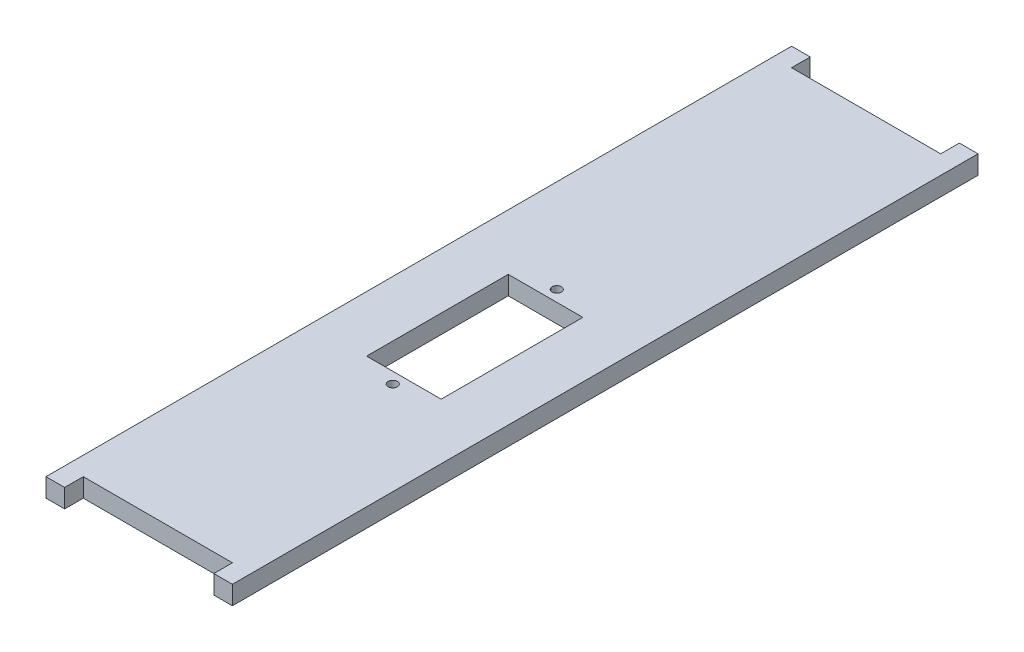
ISO-10303-21;
HEADER;
FILE_DESCRIPTION(('STEP AP214'),'2;1');
FILE_NAME('part.step','',(''),(''),'','','');
FILE_SCHEMA(('AUTOMOTIVE_DESIGN { 1 0 10303 214 1 1 1 1 }'));
ENDSEC;
DATA;
#1=APPLICATION_CONTEXT('core data for automotive mechanical design processes');
#2=APPLICATION_PROTOCOL_DEFINITION('international standard','automotive_design',2000,#1);
#3=PRODUCT_CONTEXT('',#1,'mechanical');
#4=PRODUCT('Part','Part','',(#3));
#5=PRODUCT_RELATED_PRODUCT_CATEGORY('part','',(#4));
#6=PRODUCT_DEFINITION_FORMATION('','',#4);
#7=PRODUCT_DEFINITION_CONTEXT('part definition',#1,'design');
#8=PRODUCT_DEFINITION('design','',#6,#7);
#9=PRODUCT_DEFINITION_SHAPE('','',#8);
#10=(LENGTH_UNIT() NAMED_UNIT(*) SI_UNIT(.MILLI.,.METRE.));
#11=(NAMED_UNIT(*) PLANE_ANGLE_UNIT() SI_UNIT($,.RADIAN.));
#12=(NAMED_UNIT(*) SI_UNIT($,.STERADIAN.) SOLID_ANGLE_UNIT());
#13=UNCERTAINTY_MEASURE_WITH_UNIT(LENGTH_MEASURE(1.E-05),#10,'distance_accuracy_value','');
#14=(GEOMETRIC_REPRESENTATION_CONTEXT(3) GLOBAL_UNCERTAINTY_ASSIGNED_CONTEXT((#13)) GLOBAL_UNIT_ASSIGNED_CONTEXT((#10,
#11,#12)) REPRESENTATION_CONTEXT('',''));
#15=CARTESIAN_POINT('',(0.,0.,0.));
#16=DIRECTION('',(0.,0.,1.));
#17=DIRECTION('',(1.,0.,0.));
#18=AXIS2_PLACEMENT_3D('',#15,#16,#17);
#19=CARTESIAN_POINT('',(-15.875,1.5875,-63.5));
#20=DIRECTION('',(0.,0.,1.));
#21=DIRECTION('',(1.,0.,0.));
#22=AXIS2_PLACEMENT_3D('',#19,#20,#21);
#23=PLANE('',#22);
#24=DIRECTION('',(-1.,0.,0.));
#25=VECTOR('',#24,1.);
#26=CARTESIAN_POINT('',(-15.875,1.5875,-63.5));
#27=LINE('',#26,#25);
#28=CARTESIAN_POINT('',(-12.7000000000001,1.5875,-63.5));
#29=VERTEX_POINT('',#28);
#30=CARTESIAN_POINT('',(-15.875,1.5875,-63.5));
#31=VERTEX_POINT('',#30);
#32=EDGE_CURVE('E244',#29,#31,#27,.T.);
#33=ORIENTED_EDGE('',*,*,#32,.F.);
#34=DIRECTION('',(0.,1.,0.));
#35=VECTOR('',#34,1.);
#36=CARTESIAN_POINT('',(-12.7000000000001,-1.5875,-63.5));
#37=LINE('',#36,#35);
#38=CARTESIAN_POINT('',(-12.7000000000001,-1.5875,-63.5));
#39=VERTEX_POINT('',#38);
#40=EDGE_CURVE('E206',#39,#29,#37,.T.);
#41=ORIENTED_EDGE('',*,*,#40,.F.);
#42=DIRECTION('',(-1.,0.,0.));
#43=VECTOR('',#42,1.);
#44=CARTESIAN_POINT('',(-15.875,-1.5875,-63.5));
#45=LINE('',#44,#43);
#46=CARTESIAN_POINT('',(-15.875,-1.5875,-63.5));
#47=VERTEX_POINT('',#46);
#48=EDGE_CURVE('E258',#39,#47,#45,.T.);
#49=ORIENTED_EDGE('',*,*,#48,.T.);
#50=DIRECTION('',(0.,-1.,0.));
#51=VECTOR('',#50,1.);
#52=CARTESIAN_POINT('',(-15.875,1.5875,-63.5));
#53=LINE('',#52,#51);
#54=EDGE_CURVE('E42',#31,#47,#53,.T.);
#55=ORIENTED_EDGE('',*,*,#54,.F.);
#56=EDGE_LOOP('',(#33,#41,#49,#55));
#57=FACE_BOUND('',#56,.T.);
#58=ADVANCED_FACE('F33',(#57),#23,.F.);
#59=CARTESIAN_POINT('',(-15.875,1.5875,63.5));
#60=DIRECTION('',(0.,0.,-1.));
#61=DIRECTION('',(-1.,0.,0.));
#62=AXIS2_PLACEMENT_3D('',#59,#60,#61);
#63=PLANE('',#62);
#64=DIRECTION('',(1.,0.,0.));
#65=VECTOR('',#64,1.);
#66=CARTESIAN_POINT('',(-15.875,1.5875,63.5));
#67=LINE('',#66,#65);
#68=CARTESIAN_POINT('',(12.6999999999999,1.5875,63.5));
#69=VERTEX_POINT('',#68);
#70=CARTESIAN_POINT('',(15.875,1.5875,63.5));
#71=VERTEX_POINT('',#70);
#72=EDGE_CURVE('E251',#69,#71,#67,.T.);
#73=ORIENTED_EDGE('',*,*,#72,.F.);
#74=DIRECTION('',(0.,1.,0.));
#75=VECTOR('',#74,1.);
#76=CARTESIAN_POINT('',(12.6999999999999,-1.5875,63.5));
#77=LINE('',#76,#75);
#78=CARTESIAN_POINT('',(12.6999999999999,-1.5875,63.5));
#79=VERTEX_POINT('',#78);
#80=EDGE_CURVE('E232',#79,#69,#77,.T.);
#81=ORIENTED_EDGE('',*,*,#80,.F.);
#82=DIRECTION('',(1.,0.,0.));
#83=VECTOR('',#82,1.);
#84=CARTESIAN_POINT('',(-15.875,-1.5875,63.5));
#85=LINE('',#84,#83);
#86=CARTESIAN_POINT('',(15.875,-1.5875,63.5));
#87=VERTEX_POINT('',#86);
#88=EDGE_CURVE('E264',#79,#87,#85,.T.);
#89=ORIENTED_EDGE('',*,*,#88,.T.);
#90=DIRECTION('',(0.,-1.,0.));
#91=VECTOR('',#90,1.);
#92=CARTESIAN_POINT('',(15.875,1.5875,63.5));
#93=LINE('',#92,#91);
#94=EDGE_CURVE('E255',#71,#87,#93,.T.);
#95=ORIENTED_EDGE('',*,*,#94,.F.);
#96=EDGE_LOOP('',(#73,#81,#89,#95));
#97=FACE_BOUND('',#96,.T.);
#98=ADVANCED_FACE('F329',(#97),#63,.F.);
#99=CARTESIAN_POINT('',(15.875,1.5875,-63.5));
#100=DIRECTION('',(-1.,0.,0.));
#101=DIRECTION('',(0.,0.,1.));
#102=AXIS2_PLACEMENT_3D('',#99,#100,#101);
#103=PLANE('',#102);
#104=DIRECTION('',(0.,0.,-1.));
#105=VECTOR('',#104,1.);
#106=CARTESIAN_POINT('',(15.875,-1.5875,-63.5));
#107=LINE('',#106,#105);
#108=CARTESIAN_POINT('',(15.875,-1.5875,-63.5));
#109=VERTEX_POINT('',#108);
#110=EDGE_CURVE('E234',#87,#109,#107,.T.);
#111=ORIENTED_EDGE('',*,*,#110,.T.);
#112=DIRECTION('',(0.,-1.,0.));
#113=VECTOR('',#112,1.);
#114=CARTESIAN_POINT('',(15.875,1.5875,-63.5));
#115=LINE('',#114,#113);
#116=CARTESIAN_POINT('',(15.875,1.5875,-63.5));
#117=VERTEX_POINT('',#116);
#118=EDGE_CURVE('E11',#117,#109,#115,.T.);
#119=ORIENTED_EDGE('',*,*,#118,.F.);
#120=DIRECTION('',(0.,0.,-1.));
#121=VECTOR('',#120,1.);
#122=CARTESIAN_POINT('',(15.875,1.5875,-63.5));
#123=LINE('',#122,#121);
#124=EDGE_CURVE('E241',#71,#117,#123,.T.);
#125=ORIENTED_EDGE('',*,*,#124,.F.);
#126=ORIENTED_EDGE('',*,*,#94,.T.);
#127=EDGE_LOOP('',(#111,#119,#125,#126));
#128=FACE_BOUND('',#127,.T.);
#129=ADVANCED_FACE('F35',(#128),#103,.F.);
#130=CARTESIAN_POINT('',(12.6999999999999,-1.5875,-63.5));
#131=VERTEX_POINT('',#130);
#132=EDGE_CURVE('E259',#109,#131,#45,.T.);
#133=ORIENTED_EDGE('',*,*,#132,.T.);
#134=DIRECTION('',(0.,1.,0.));
#135=VECTOR('',#134,1.);
#136=CARTESIAN_POINT('',(12.6999999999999,-1.5875,-63.5));
#137=LINE('',#136,#135);
#138=CARTESIAN_POINT('',(12.6999999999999,1.5875,-63.5));
#139=VERTEX_POINT('',#138);
#140=EDGE_CURVE('E209',#131,#139,#137,.T.);
#141=ORIENTED_EDGE('',*,*,#140,.T.);
#142=EDGE_CURVE('E246',#117,#139,#27,.T.);
#143=ORIENTED_EDGE('',*,*,#142,.F.);
#144=ORIENTED_EDGE('',*,*,#118,.T.);
#145=EDGE_LOOP('',(#133,#141,#143,#144));
#146=FACE_BOUND('',#145,.T.);
#147=ADVANCED_FACE('F335',(#146),#23,.F.);
#148=CARTESIAN_POINT('',(-15.875,1.5875,-63.5));
#149=DIRECTION('',(1.,0.,0.));
#150=DIRECTION('',(0.,0.,-1.));
#151=AXIS2_PLACEMENT_3D('',#148,#149,#150);
#152=PLANE('',#151);
#153=DIRECTION('',(0.,0.,1.));
#154=VECTOR('',#153,1.);
#155=CARTESIAN_POINT('',(-15.875,-1.5875,-63.5));
#156=LINE('',#155,#154);
#157=CARTESIAN_POINT('',(-15.875,-1.5875,63.5));
#158=VERTEX_POINT('',#157);
#159=EDGE_CURVE('E262',#47,#158,#156,.T.);
#160=ORIENTED_EDGE('',*,*,#159,.T.);
#161=DIRECTION('',(0.,-1.,0.));
#162=VECTOR('',#161,1.);
#163=CARTESIAN_POINT('',(-15.875,1.5875,63.5));
#164=LINE('',#163,#162);
#165=CARTESIAN_POINT('',(-15.875,1.5875,63.5));
#166=VERTEX_POINT('',#165);
#167=EDGE_CURVE('E269',#166,#158,#164,.T.);
#168=ORIENTED_EDGE('',*,*,#167,.F.);
#169=DIRECTION('',(0.,0.,1.));
#170=VECTOR('',#169,1.);
#171=CARTESIAN_POINT('',(-15.875,1.5875,-63.5));
#172=LINE('',#171,#170);
#173=EDGE_CURVE('E249',#31,#166,#172,.T.);
#174=ORIENTED_EDGE('',*,*,#173,.F.);
#175=ORIENTED_EDGE('',*,*,#54,.T.);
#176=EDGE_LOOP('',(#160,#168,#174,#175));
#177=FACE_BOUND('',#176,.T.);
#178=ADVANCED_FACE('F310',(#177),#152,.F.);
#179=CARTESIAN_POINT('',(-12.7000000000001,-1.5875,63.5));
#180=VERTEX_POINT('',#179);
#181=EDGE_CURVE('E245',#158,#180,#85,.T.);
#182=ORIENTED_EDGE('',*,*,#181,.T.);
#183=DIRECTION('',(0.,1.,0.));
#184=VECTOR('',#183,1.);
#185=CARTESIAN_POINT('',(-12.7000000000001,-1.5875,63.5));
#186=LINE('',#185,#184);
#187=CARTESIAN_POINT('',(-12.7000000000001,1.5875,63.5));
#188=VERTEX_POINT('',#187);
#189=EDGE_CURVE('E235',#180,#188,#186,.T.);
#190=ORIENTED_EDGE('',*,*,#189,.T.);
#191=EDGE_CURVE('E252',#166,#188,#67,.T.);
#192=ORIENTED_EDGE('',*,*,#191,.F.);
#193=ORIENTED_EDGE('',*,*,#167,.T.);
#194=EDGE_LOOP('',(#182,#190,#192,#193));
#195=FACE_BOUND('',#194,.T.);
#196=ADVANCED_FACE('F292',(#195),#63,.F.);
#197=CARTESIAN_POINT('',(15.875,1.5875,63.5));
#198=DIRECTION('',(0.,1.,0.));
#199=DIRECTION('',(0.,0.,1.));
#200=AXIS2_PLACEMENT_3D('',#197,#198,#199);
#201=PLANE('',#200);
#202=CARTESIAN_POINT('',(0.,1.5875,20.32));
#203=DIRECTION('',(0.,1.,0.));
#204=DIRECTION('',(0.,0.,1.));
#205=AXIS2_PLACEMENT_3D('',#202,#203,#204);
#206=CIRCLE('',#205,0.793749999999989);
#207=CARTESIAN_POINT('',(0.,1.5875,21.11375));
#208=VERTEX_POINT('',#207);
#209=EDGE_CURVE('E280',#208,#208,#206,.T.);
#210=ORIENTED_EDGE('',*,*,#209,.F.);
#211=EDGE_LOOP('',(#210));
#212=FACE_BOUND('',#211,.T.);
#213=CARTESIAN_POINT('',(0.,1.5875,-7.62));
#214=DIRECTION('',(0.,1.,0.));
#215=DIRECTION('',(0.,0.,1.));
#216=AXIS2_PLACEMENT_3D('',#213,#214,#215);
#217=CIRCLE('',#216,0.793749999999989);
#218=CARTESIAN_POINT('',(0.,1.5875,-6.82625000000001));
#219=VERTEX_POINT('',#218);
#220=EDGE_CURVE('E172',#219,#219,#217,.T.);
#221=ORIENTED_EDGE('',*,*,#220,.F.);
#222=EDGE_LOOP('',(#221));
#223=FACE_BOUND('',#222,.T.);
#224=DIRECTION('',(0.,0.,-1.));
#225=VECTOR('',#224,1.);
#226=CARTESIAN_POINT('',(6.35,1.5875,-5.715));
#227=LINE('',#226,#225);
#228=CARTESIAN_POINT('',(6.35,1.5875,18.415));
#229=VERTEX_POINT('',#228);
#230=CARTESIAN_POINT('',(6.35,1.5875,-5.715));
#231=VERTEX_POINT('',#230);
#232=EDGE_CURVE('E50',#229,#231,#227,.T.);
#233=ORIENTED_EDGE('',*,*,#232,.F.);
#234=DIRECTION('',(1.,0.,0.));
#235=VECTOR('',#234,1.);
#236=CARTESIAN_POINT('',(-6.35,1.5875,18.415));
#237=LINE('',#236,#235);
#238=CARTESIAN_POINT('',(-6.35,1.5875,18.415));
#239=VERTEX_POINT('',#238);
#240=EDGE_CURVE('E166',#239,#229,#237,.T.);
#241=ORIENTED_EDGE('',*,*,#240,.F.);
#242=DIRECTION('',(0.,0.,1.));
#243=VECTOR('',#242,1.);
#244=CARTESIAN_POINT('',(-6.35,1.5875,-5.715));
#245=LINE('',#244,#243);
#246=CARTESIAN_POINT('',(-6.35,1.5875,-5.715));
#247=VERTEX_POINT('',#246);
#248=EDGE_CURVE('E169',#247,#239,#245,.T.);
#249=ORIENTED_EDGE('',*,*,#248,.F.);
#250=DIRECTION('',(-1.,0.,0.));
#251=VECTOR('',#250,1.);
#252=CARTESIAN_POINT('',(-6.35,1.5875,-5.715));
#253=LINE('',#252,#251);
#254=EDGE_CURVE('E178',#231,#247,#253,.T.);
#255=ORIENTED_EDGE('',*,*,#254,.F.);
#256=EDGE_LOOP('',(#233,#241,#249,#255));
#257=FACE_BOUND('',#256,.T.);
#258=DIRECTION('',(0.,0.,1.));
#259=VECTOR('',#258,1.);
#260=CARTESIAN_POINT('',(-12.7000000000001,1.5875,-60.325));
#261=LINE('',#260,#259);
#262=CARTESIAN_POINT('',(-12.7000000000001,1.5875,-60.325));
#263=VERTEX_POINT('',#262);
#264=EDGE_CURVE('E185',#29,#263,#261,.T.);
#265=ORIENTED_EDGE('',*,*,#264,.F.);
#266=ORIENTED_EDGE('',*,*,#32,.T.);
#267=ORIENTED_EDGE('',*,*,#173,.T.);
#268=ORIENTED_EDGE('',*,*,#191,.T.);
#269=DIRECTION('',(0.,0.,1.));
#270=VECTOR('',#269,1.);
#271=CARTESIAN_POINT('',(-12.7000000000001,1.5875,60.325));
#272=LINE('',#271,#270);
#273=CARTESIAN_POINT('',(-12.7000000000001,1.5875,60.325));
#274=VERTEX_POINT('',#273);
#275=EDGE_CURVE('E219',#274,#188,#272,.T.);
#276=ORIENTED_EDGE('',*,*,#275,.F.);
#277=DIRECTION('',(-1.,0.,0.));
#278=VECTOR('',#277,1.);
#279=CARTESIAN_POINT('',(-12.7000000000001,1.5875,60.325));
#280=LINE('',#279,#278);
#281=CARTESIAN_POINT('',(12.6999999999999,1.5875,60.325));
#282=VERTEX_POINT('',#281);
#283=EDGE_CURVE('E228',#282,#274,#280,.T.);
#284=ORIENTED_EDGE('',*,*,#283,.F.);
#285=DIRECTION('',(0.,0.,-1.));
#286=VECTOR('',#285,1.);
#287=CARTESIAN_POINT('',(12.6999999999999,1.5875,60.325));
#288=LINE('',#287,#286);
#289=EDGE_CURVE('E208',#69,#282,#288,.T.);
#290=ORIENTED_EDGE('',*,*,#289,.F.);
#291=ORIENTED_EDGE('',*,*,#72,.T.);
#292=ORIENTED_EDGE('',*,*,#124,.T.);
#293=ORIENTED_EDGE('',*,*,#142,.T.);
#294=DIRECTION('',(0.,0.,-1.));
#295=VECTOR('',#294,1.);
#296=CARTESIAN_POINT('',(12.6999999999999,1.5875,-60.325));
#297=LINE('',#296,#295);
#298=CARTESIAN_POINT('',(12.6999999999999,1.5875,-60.325));
#299=VERTEX_POINT('',#298);
#300=EDGE_CURVE('E193',#299,#139,#297,.T.);
#301=ORIENTED_EDGE('',*,*,#300,.F.);
#302=DIRECTION('',(1.,0.,0.));
#303=VECTOR('',#302,1.);
#304=CARTESIAN_POINT('',(-12.7000000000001,1.5875,-60.325));
#305=LINE('',#304,#303);
#306=EDGE_CURVE('E202',#263,#299,#305,.T.);
#307=ORIENTED_EDGE('',*,*,#306,.F.);
#308=EDGE_LOOP('',(#265,#266,#267,#268,#276,#284,#290,#291,#292,#293,#301,#307));
#309=FACE_BOUND('',#308,.T.);
#310=ADVANCED_FACE('F289',(#212,#223,#257,#309),#201,.T.);
#311=CARTESIAN_POINT('',(15.875,-1.5875,63.5));
#312=DIRECTION('',(0.,1.,0.));
#313=DIRECTION('',(0.,0.,1.));
#314=AXIS2_PLACEMENT_3D('',#311,#312,#313);
#315=PLANE('',#314);
#316=CARTESIAN_POINT('',(0.,-1.5875,20.32));
#317=DIRECTION('',(0.,1.,0.));
#318=DIRECTION('',(0.,0.,1.));
#319=AXIS2_PLACEMENT_3D('',#316,#317,#318);
#320=CIRCLE('',#319,0.793749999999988);
#321=CARTESIAN_POINT('',(0.,-1.5875,21.11375));
#322=VERTEX_POINT('',#321);
#323=EDGE_CURVE('E37',#322,#322,#320,.T.);
#324=ORIENTED_EDGE('',*,*,#323,.T.);
#325=EDGE_LOOP('',(#324));
#326=FACE_BOUND('',#325,.T.);
#327=CARTESIAN_POINT('',(0.,-1.5875,-7.62));
#328=DIRECTION('',(0.,1.,0.));
#329=DIRECTION('',(0.,0.,1.));
#330=AXIS2_PLACEMENT_3D('',#327,#328,#329);
#331=CIRCLE('',#330,0.793749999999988);
#332=CARTESIAN_POINT('',(0.,-1.5875,-6.82625000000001));
#333=VERTEX_POINT('',#332);
#334=EDGE_CURVE('E179',#333,#333,#331,.T.);
#335=ORIENTED_EDGE('',*,*,#334,.T.);
#336=EDGE_LOOP('',(#335));
#337=FACE_BOUND('',#336,.T.);
#338=DIRECTION('',(1.,0.,0.));
#339=VECTOR('',#338,1.);
#340=CARTESIAN_POINT('',(-6.35,-1.5875,18.415));
#341=LINE('',#340,#339);
#342=CARTESIAN_POINT('',(-6.35,-1.5875,18.415));
#343=VERTEX_POINT('',#342);
#344=CARTESIAN_POINT('',(6.35,-1.5875,18.415));
#345=VERTEX_POINT('',#344);
#346=EDGE_CURVE('E156',#343,#345,#341,.T.);
#347=ORIENTED_EDGE('',*,*,#346,.T.);
#348=DIRECTION('',(0.,0.,-1.));
#349=VECTOR('',#348,1.);
#350=CARTESIAN_POINT('',(6.35,-1.5875,-5.715));
#351=LINE('',#350,#349);
#352=CARTESIAN_POINT('',(6.35,-1.5875,-5.715));
#353=VERTEX_POINT('',#352);
#354=EDGE_CURVE('E150',#345,#353,#351,.T.);
#355=ORIENTED_EDGE('',*,*,#354,.T.);
#356=DIRECTION('',(-1.,0.,0.));
#357=VECTOR('',#356,1.);
#358=CARTESIAN_POINT('',(-6.35,-1.5875,-5.715));
#359=LINE('',#358,#357);
#360=CARTESIAN_POINT('',(-6.35,-1.5875,-5.715));
#361=VERTEX_POINT('',#360);
#362=EDGE_CURVE('E159',#353,#361,#359,.T.);
#363=ORIENTED_EDGE('',*,*,#362,.T.);
#364=DIRECTION('',(0.,0.,1.));
#365=VECTOR('',#364,1.);
#366=CARTESIAN_POINT('',(-6.35,-1.5875,-5.715));
#367=LINE('',#366,#365);
#368=EDGE_CURVE('E58',#361,#343,#367,.T.);
#369=ORIENTED_EDGE('',*,*,#368,.T.);
#370=EDGE_LOOP('',(#347,#355,#363,#369));
#371=FACE_BOUND('',#370,.T.);
#372=ORIENTED_EDGE('',*,*,#48,.F.);
#373=DIRECTION('',(0.,0.,1.));
#374=VECTOR('',#373,1.);
#375=CARTESIAN_POINT('',(-12.7000000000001,-1.5875,-60.325));
#376=LINE('',#375,#374);
#377=CARTESIAN_POINT('',(-12.7000000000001,-1.5875,-60.325));
#378=VERTEX_POINT('',#377);
#379=EDGE_CURVE('E189',#39,#378,#376,.T.);
#380=ORIENTED_EDGE('',*,*,#379,.T.);
#381=DIRECTION('',(1.,0.,0.));
#382=VECTOR('',#381,1.);
#383=CARTESIAN_POINT('',(-12.7000000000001,-1.5875,-60.325));
#384=LINE('',#383,#382);
#385=CARTESIAN_POINT('',(12.6999999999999,-1.5875,-60.325));
#386=VERTEX_POINT('',#385);
#387=EDGE_CURVE('E192',#378,#386,#384,.T.);
#388=ORIENTED_EDGE('',*,*,#387,.T.);
#389=DIRECTION('',(0.,0.,-1.));
#390=VECTOR('',#389,1.);
#391=CARTESIAN_POINT('',(12.6999999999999,-1.5875,-60.325));
#392=LINE('',#391,#390);
#393=EDGE_CURVE('E196',#386,#131,#392,.T.);
#394=ORIENTED_EDGE('',*,*,#393,.T.);
#395=ORIENTED_EDGE('',*,*,#132,.F.);
#396=ORIENTED_EDGE('',*,*,#110,.F.);
#397=ORIENTED_EDGE('',*,*,#88,.F.);
#398=DIRECTION('',(0.,0.,-1.));
#399=VECTOR('',#398,1.);
#400=CARTESIAN_POINT('',(12.6999999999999,-1.5875,60.325));
#401=LINE('',#400,#399);
#402=CARTESIAN_POINT('',(12.6999999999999,-1.5875,60.325));
#403=VERTEX_POINT('',#402);
#404=EDGE_CURVE('E215',#79,#403,#401,.T.);
#405=ORIENTED_EDGE('',*,*,#404,.T.);
#406=DIRECTION('',(-1.,0.,0.));
#407=VECTOR('',#406,1.);
#408=CARTESIAN_POINT('',(-12.7000000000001,-1.5875,60.325));
#409=LINE('',#408,#407);
#410=CARTESIAN_POINT('',(-12.7000000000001,-1.5875,60.325));
#411=VERTEX_POINT('',#410);
#412=EDGE_CURVE('E218',#403,#411,#409,.T.);
#413=ORIENTED_EDGE('',*,*,#412,.T.);
#414=DIRECTION('',(0.,0.,1.));
#415=VECTOR('',#414,1.);
#416=CARTESIAN_POINT('',(-12.7000000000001,-1.5875,60.325));
#417=LINE('',#416,#415);
#418=EDGE_CURVE('E222',#411,#180,#417,.T.);
#419=ORIENTED_EDGE('',*,*,#418,.T.);
#420=ORIENTED_EDGE('',*,*,#181,.F.);
#421=ORIENTED_EDGE('',*,*,#159,.F.);
#422=EDGE_LOOP('',(#372,#380,#388,#394,#395,#396,#397,#405,#413,#419,#420,#421));
#423=FACE_BOUND('',#422,.T.);
#424=ADVANCED_FACE('F163',(#326,#337,#371,#423),#315,.F.);
#425=CARTESIAN_POINT('',(12.6999999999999,-1.5875,60.325));
#426=DIRECTION('',(1.,0.,0.));
#427=DIRECTION('',(0.,0.,-1.));
#428=AXIS2_PLACEMENT_3D('',#425,#426,#427);
#429=PLANE('',#428);
#430=ORIENTED_EDGE('',*,*,#289,.T.);
#431=DIRECTION('',(0.,1.,0.));
#432=VECTOR('',#431,1.);
#433=CARTESIAN_POINT('',(12.6999999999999,-1.5875,60.325));
#434=LINE('',#433,#432);
#435=EDGE_CURVE('E225',#403,#282,#434,.T.);
#436=ORIENTED_EDGE('',*,*,#435,.F.);
#437=ORIENTED_EDGE('',*,*,#404,.F.);
#438=ORIENTED_EDGE('',*,*,#80,.T.);
#439=EDGE_LOOP('',(#430,#436,#437,#438));
#440=FACE_BOUND('',#439,.T.);
#441=ADVANCED_FACE('F392',(#440),#429,.F.);
#442=CARTESIAN_POINT('',(-12.7000000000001,-1.5875,60.325));
#443=DIRECTION('',(-1.,0.,0.));
#444=DIRECTION('',(0.,0.,1.));
#445=AXIS2_PLACEMENT_3D('',#442,#443,#444);
#446=PLANE('',#445);
#447=ORIENTED_EDGE('',*,*,#275,.T.);
#448=ORIENTED_EDGE('',*,*,#189,.F.);
#449=ORIENTED_EDGE('',*,*,#418,.F.);
#450=DIRECTION('',(0.,1.,0.));
#451=VECTOR('',#450,1.);
#452=CARTESIAN_POINT('',(-12.7000000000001,-1.5875,60.325));
#453=LINE('',#452,#451);
#454=EDGE_CURVE('E238',#411,#274,#453,.T.);
#455=ORIENTED_EDGE('',*,*,#454,.T.);
#456=EDGE_LOOP('',(#447,#448,#449,#455));
#457=FACE_BOUND('',#456,.T.);
#458=ADVANCED_FACE('F317',(#457),#446,.F.);
#459=CARTESIAN_POINT('',(-12.7000000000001,-1.5875,60.325));
#460=DIRECTION('',(0.,0.,-1.));
#461=DIRECTION('',(-1.,0.,0.));
#462=AXIS2_PLACEMENT_3D('',#459,#460,#461);
#463=PLANE('',#462);
#464=ORIENTED_EDGE('',*,*,#283,.T.);
#465=ORIENTED_EDGE('',*,*,#454,.F.);
#466=ORIENTED_EDGE('',*,*,#412,.F.);
#467=ORIENTED_EDGE('',*,*,#435,.T.);
#468=EDGE_LOOP('',(#464,#465,#466,#467));
#469=FACE_BOUND('',#468,.T.);
#470=ADVANCED_FACE('F322',(#469),#463,.F.);
#471=CARTESIAN_POINT('',(-12.7000000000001,-1.5875,-60.325));
#472=DIRECTION('',(-1.,0.,0.));
#473=DIRECTION('',(0.,0.,1.));
#474=AXIS2_PLACEMENT_3D('',#471,#472,#473);
#475=PLANE('',#474);
#476=ORIENTED_EDGE('',*,*,#264,.T.);
#477=DIRECTION('',(0.,1.,0.));
#478=VECTOR('',#477,1.);
#479=CARTESIAN_POINT('',(-12.7000000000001,-1.5875,-60.325));
#480=LINE('',#479,#478);
#481=EDGE_CURVE('E199',#378,#263,#480,.T.);
#482=ORIENTED_EDGE('',*,*,#481,.F.);
#483=ORIENTED_EDGE('',*,*,#379,.F.);
#484=ORIENTED_EDGE('',*,*,#40,.T.);
#485=EDGE_LOOP('',(#476,#482,#483,#484));
#486=FACE_BOUND('',#485,.T.);
#487=ADVANCED_FACE('F342',(#486),#475,.F.);
#488=CARTESIAN_POINT('',(12.6999999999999,-1.5875,-60.325));
#489=DIRECTION('',(1.,0.,0.));
#490=DIRECTION('',(0.,0.,-1.));
#491=AXIS2_PLACEMENT_3D('',#488,#489,#490);
#492=PLANE('',#491);
#493=ORIENTED_EDGE('',*,*,#300,.T.);
#494=ORIENTED_EDGE('',*,*,#140,.F.);
#495=ORIENTED_EDGE('',*,*,#393,.F.);
#496=DIRECTION('',(0.,1.,0.));
#497=VECTOR('',#496,1.);
#498=CARTESIAN_POINT('',(12.6999999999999,-1.5875,-60.325));
#499=LINE('',#498,#497);
#500=EDGE_CURVE('E212',#386,#299,#499,.T.);
#501=ORIENTED_EDGE('',*,*,#500,.T.);
#502=EDGE_LOOP('',(#493,#494,#495,#501));
#503=FACE_BOUND('',#502,.T.);
#504=ADVANCED_FACE('F337',(#503),#492,.F.);
#505=CARTESIAN_POINT('',(-12.7000000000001,-1.5875,-60.325));
#506=DIRECTION('',(0.,0.,1.));
#507=DIRECTION('',(1.,0.,0.));
#508=AXIS2_PLACEMENT_3D('',#505,#506,#507);
#509=PLANE('',#508);
#510=ORIENTED_EDGE('',*,*,#306,.T.);
#511=ORIENTED_EDGE('',*,*,#500,.F.);
#512=ORIENTED_EDGE('',*,*,#387,.F.);
#513=ORIENTED_EDGE('',*,*,#481,.T.);
#514=EDGE_LOOP('',(#510,#511,#512,#513));
#515=FACE_BOUND('',#514,.T.);
#516=ADVANCED_FACE('F341',(#515),#509,.F.);
#517=CARTESIAN_POINT('',(6.35,-1.5875,-5.715));
#518=DIRECTION('',(1.,0.,0.));
#519=DIRECTION('',(0.,0.,-1.));
#520=AXIS2_PLACEMENT_3D('',#517,#518,#519);
#521=PLANE('',#520);
#522=ORIENTED_EDGE('',*,*,#232,.T.);
#523=DIRECTION('',(0.,1.,0.));
#524=VECTOR('',#523,1.);
#525=CARTESIAN_POINT('',(6.35,-1.5875,-5.715));
#526=LINE('',#525,#524);
#527=EDGE_CURVE('E146',#353,#231,#526,.T.);
#528=ORIENTED_EDGE('',*,*,#527,.F.);
#529=ORIENTED_EDGE('',*,*,#354,.F.);
#530=DIRECTION('',(0.,1.,0.));
#531=VECTOR('',#530,1.);
#532=CARTESIAN_POINT('',(6.35,-1.5875,18.415));
#533=LINE('',#532,#531);
#534=EDGE_CURVE('E183',#345,#229,#533,.T.);
#535=ORIENTED_EDGE('',*,*,#534,.T.);
#536=EDGE_LOOP('',(#522,#528,#529,#535));
#537=FACE_BOUND('',#536,.T.);
#538=ADVANCED_FACE('F148',(#537),#521,.F.);
#539=CARTESIAN_POINT('',(-6.35,-1.5875,18.415));
#540=DIRECTION('',(0.,0.,1.));
#541=DIRECTION('',(1.,0.,0.));
#542=AXIS2_PLACEMENT_3D('',#539,#540,#541);
#543=PLANE('',#542);
#544=ORIENTED_EDGE('',*,*,#240,.T.);
#545=ORIENTED_EDGE('',*,*,#534,.F.);
#546=ORIENTED_EDGE('',*,*,#346,.F.);
#547=DIRECTION('',(0.,1.,0.));
#548=VECTOR('',#547,1.);
#549=CARTESIAN_POINT('',(-6.35,-1.5875,18.415));
#550=LINE('',#549,#548);
#551=EDGE_CURVE('E186',#343,#239,#550,.T.);
#552=ORIENTED_EDGE('',*,*,#551,.T.);
#553=EDGE_LOOP('',(#544,#545,#546,#552));
#554=FACE_BOUND('',#553,.T.);
#555=ADVANCED_FACE('F436',(#554),#543,.F.);
#556=CARTESIAN_POINT('',(-6.35,-1.5875,-5.715));
#557=DIRECTION('',(-1.,0.,0.));
#558=DIRECTION('',(0.,0.,1.));
#559=AXIS2_PLACEMENT_3D('',#556,#557,#558);
#560=PLANE('',#559);
#561=ORIENTED_EDGE('',*,*,#248,.T.);
#562=ORIENTED_EDGE('',*,*,#551,.F.);
#563=ORIENTED_EDGE('',*,*,#368,.F.);
#564=DIRECTION('',(0.,1.,0.));
#565=VECTOR('',#564,1.);
#566=CARTESIAN_POINT('',(-6.35,-1.5875,-5.715));
#567=LINE('',#566,#565);
#568=EDGE_CURVE('E155',#361,#247,#567,.T.);
#569=ORIENTED_EDGE('',*,*,#568,.T.);
#570=EDGE_LOOP('',(#561,#562,#563,#569));
#571=FACE_BOUND('',#570,.T.);
#572=ADVANCED_FACE('F445',(#571),#560,.F.);
#573=CARTESIAN_POINT('',(-6.35,-1.5875,-5.715));
#574=DIRECTION('',(0.,0.,-1.));
#575=DIRECTION('',(-1.,0.,0.));
#576=AXIS2_PLACEMENT_3D('',#573,#574,#575);
#577=PLANE('',#576);
#578=ORIENTED_EDGE('',*,*,#254,.T.);
#579=ORIENTED_EDGE('',*,*,#568,.F.);
#580=ORIENTED_EDGE('',*,*,#362,.F.);
#581=ORIENTED_EDGE('',*,*,#527,.T.);
#582=EDGE_LOOP('',(#578,#579,#580,#581));
#583=FACE_BOUND('',#582,.T.);
#584=ADVANCED_FACE('F160',(#583),#577,.F.);
#585=CARTESIAN_POINT('',(0.,1.5875,-7.62));
#586=DIRECTION('',(0.,1.,0.));
#587=DIRECTION('',(0.,0.,1.));
#588=AXIS2_PLACEMENT_3D('',#585,#586,#587);
#589=CYLINDRICAL_SURFACE('',#588,0.793749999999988);
#590=ORIENTED_EDGE('',*,*,#220,.T.);
#591=EDGE_LOOP('',(#590));
#592=FACE_BOUND('',#591,.T.);
#593=ORIENTED_EDGE('',*,*,#334,.F.);
#594=EDGE_LOOP('',(#593));
#595=FACE_BOUND('',#594,.T.);
#596=ADVANCED_FACE('F463',(#592,#595),#589,.F.);
#597=CARTESIAN_POINT('',(0.,1.5875,20.32));
#598=DIRECTION('',(0.,1.,0.));
#599=DIRECTION('',(0.,0.,1.));
#600=AXIS2_PLACEMENT_3D('',#597,#598,#599);
#601=CYLINDRICAL_SURFACE('',#600,0.793749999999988);
#602=ORIENTED_EDGE('',*,*,#209,.T.);
#603=EDGE_LOOP('',(#602));
#604=FACE_BOUND('',#603,.T.);
#605=ORIENTED_EDGE('',*,*,#323,.F.);
#606=EDGE_LOOP('',(#605));
#607=FACE_BOUND('',#606,.T.);
#608=ADVANCED_FACE('F286',(#604,#607),#601,.F.);
#609=CLOSED_SHELL('',(#58,#98,#129,#147,#178,#196,#310,#424,#441,#458,#470,#487,#504,#516,#538,
#555,#572,#584,#596,#608));
#610=MANIFOLD_SOLID_BREP('B2',#609);
#611=ADVANCED_BREP_SHAPE_REPRESENTATION('',(#18,#610),#14);
#612=SHAPE_DEFINITION_REPRESENTATION(#9,#611);
ENDSEC;
END-ISO-10303-21;
